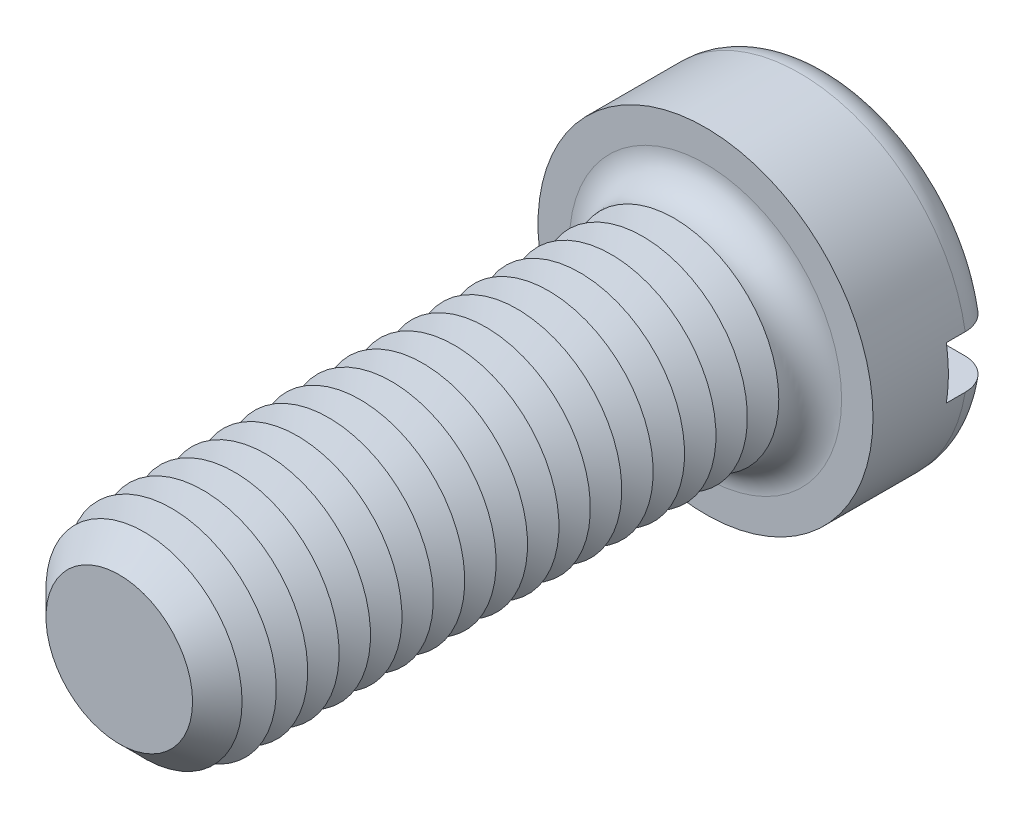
from build123d import *

# Parameters (mm, degrees)
SKETCH3_R           = 8
BOSS_EXTRUDE2_DEPTH = 6
SKETCH4_R           = 5
BOSS_EXTRUDE3_DEPTH = 28
FILLET1_R           = 1.5
CHAMFER1_SIZE       = 1.5
LPATTERN1_COUNT     = 17
LPATTERN1_PITCH     = 1.5
SKETCH8_W           = 16
SKETCH8_H           = 2.5
CUT_EXTRUDE1_DEPTH  = 2.4


with BuildPart() as part:
    # Sketch3 → Boss-Extrude2 (new body)
    with BuildSketch(Plane.XY):
        Circle(SKETCH3_R)
    extrude(amount=-BOSS_EXTRUDE2_DEPTH)

    # Sketch4 → Boss-Extrude3 (add)
    with BuildSketch(Plane.XY):
        Circle(SKETCH4_R)
    extrude(amount=BOSS_EXTRUDE3_DEPTH)

    # Fillet1
    fillet1_edges = [part.edges().sort_by_distance(p)[0] for p in [
        (-8, 0, -6),
        (-5, 0, 0),
    ]]
    fillet(fillet1_edges, radius=FILLET1_R)

    # Chamfer1
    chamfer1_edges = [part.edges().sort_by_distance(p)[0] for p in [
        (-5, 0, 28),
    ]]
    chamfer(chamfer1_edges, length=CHAMFER1_SIZE)

    # Sketch6 → Cut-Revolve1 (revolve, cut)
    with BuildSketch(Plane(origin=(0, 0, 0), x_dir=(0, 0, -1), z_dir=(1, 0, 0)), mode=Mode.PRIVATE) as cut_revolve1_sk:
        Polygon((-1.5, 5), (-2.25, 3.700961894), (-3, 5), align=None)
    cut_revolve1 = revolve(cut_revolve1_sk.sketch.rotate(Axis((0, 0, -1.694361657), (0, 0, 1)), 90), axis=Axis((0, 0, -1.694361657), (0, 0, 1)), mode=Mode.SUBTRACT)

    # LPattern1: Cut-Revolve1 ×17
    with Locations(*[(0, 0, i * LPATTERN1_PITCH) for i in range(1, LPATTERN1_COUNT)]):
        add(cut_revolve1, mode=Mode.SUBTRACT)

    # Sketch8 → Cut-Extrude1 (cut)
    with BuildSketch(Plane(origin=(0, 0, -6), x_dir=(-1, 0, 0), z_dir=(0, 0, -1))):
        Rectangle(SKETCH8_W, SKETCH8_H)
    extrude(amount=-CUT_EXTRUDE1_DEPTH, mode=Mode.SUBTRACT)


solid = part.part
